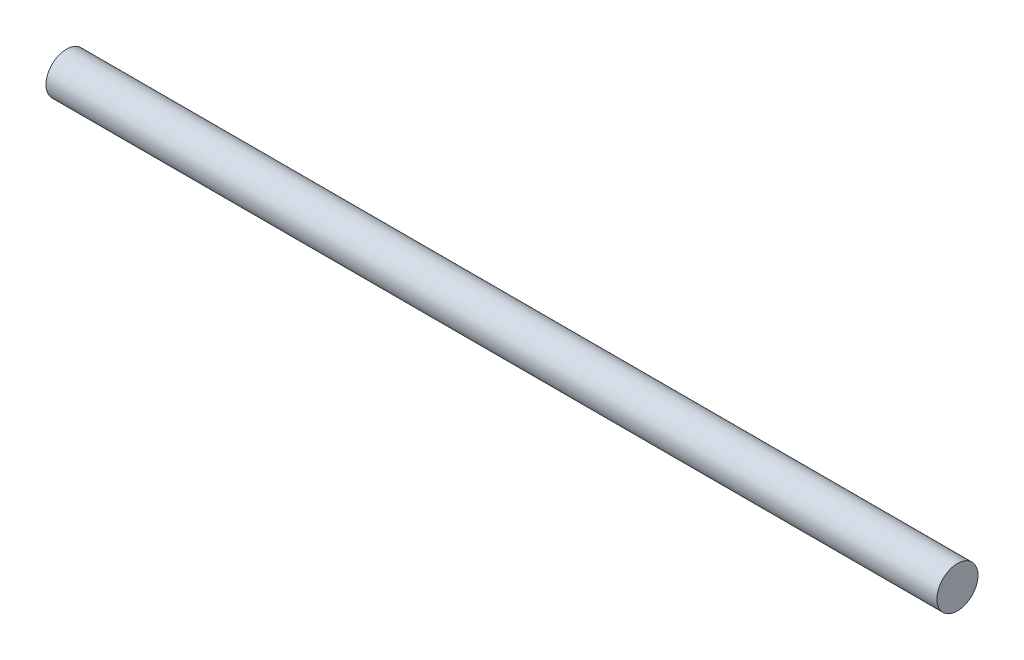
ISO-10303-21;
HEADER;
FILE_DESCRIPTION(('STEP AP214'),'2;1');
FILE_NAME('part.step','',(''),(''),'','','');
FILE_SCHEMA(('AUTOMOTIVE_DESIGN { 1 0 10303 214 1 1 1 1 }'));
ENDSEC;
DATA;
#1=APPLICATION_CONTEXT('core data for automotive mechanical design processes');
#2=APPLICATION_PROTOCOL_DEFINITION('international standard','automotive_design',2000,#1);
#3=PRODUCT_CONTEXT('',#1,'mechanical');
#4=PRODUCT('Part','Part','',(#3));
#5=PRODUCT_RELATED_PRODUCT_CATEGORY('part','',(#4));
#6=PRODUCT_DEFINITION_FORMATION('','',#4);
#7=PRODUCT_DEFINITION_CONTEXT('part definition',#1,'design');
#8=PRODUCT_DEFINITION('design','',#6,#7);
#9=PRODUCT_DEFINITION_SHAPE('','',#8);
#10=(LENGTH_UNIT() NAMED_UNIT(*) SI_UNIT(.MILLI.,.METRE.));
#11=(NAMED_UNIT(*) PLANE_ANGLE_UNIT() SI_UNIT($,.RADIAN.));
#12=(NAMED_UNIT(*) SI_UNIT($,.STERADIAN.) SOLID_ANGLE_UNIT());
#13=UNCERTAINTY_MEASURE_WITH_UNIT(LENGTH_MEASURE(1.E-05),#10,'distance_accuracy_value','');
#14=(GEOMETRIC_REPRESENTATION_CONTEXT(3) GLOBAL_UNCERTAINTY_ASSIGNED_CONTEXT((#13)) GLOBAL_UNIT_ASSIGNED_CONTEXT((#10,
#11,#12)) REPRESENTATION_CONTEXT('',''));
#15=CARTESIAN_POINT('',(0.,0.,0.));
#16=DIRECTION('',(0.,0.,1.));
#17=DIRECTION('',(1.,0.,0.));
#18=AXIS2_PLACEMENT_3D('',#15,#16,#17);
#19=CARTESIAN_POINT('',(65.,0.,0.));
#20=DIRECTION('',(-1.,0.,0.));
#21=DIRECTION('',(0.,0.,1.));
#22=AXIS2_PLACEMENT_3D('',#19,#20,#21);
#23=CYLINDRICAL_SURFACE('',#22,1.5);
#24=CARTESIAN_POINT('',(65.,0.,0.));
#25=DIRECTION('',(1.,0.,0.));
#26=DIRECTION('',(0.,0.,-1.));
#27=AXIS2_PLACEMENT_3D('',#24,#25,#26);
#28=CIRCLE('',#27,1.5);
#29=CARTESIAN_POINT('',(65.,0.,-1.5));
#30=VERTEX_POINT('',#29);
#31=EDGE_CURVE('E10',#30,#30,#28,.T.);
#32=ORIENTED_EDGE('',*,*,#31,.F.);
#33=EDGE_LOOP('',(#32));
#34=FACE_BOUND('',#33,.T.);
#35=CARTESIAN_POINT('',(0.,0.,0.));
#36=DIRECTION('',(1.,0.,0.));
#37=DIRECTION('',(0.,0.,-1.));
#38=AXIS2_PLACEMENT_3D('',#35,#36,#37);
#39=CIRCLE('',#38,1.5);
#40=CARTESIAN_POINT('',(0.,0.,-1.5));
#41=VERTEX_POINT('',#40);
#42=EDGE_CURVE('E33',#41,#41,#39,.T.);
#43=ORIENTED_EDGE('',*,*,#42,.T.);
#44=EDGE_LOOP('',(#43));
#45=FACE_BOUND('',#44,.T.);
#46=ADVANCED_FACE('F30',(#34,#45),#23,.T.);
#47=CARTESIAN_POINT('',(65.,0.,0.));
#48=DIRECTION('',(1.,0.,0.));
#49=DIRECTION('',(0.,0.,-1.));
#50=AXIS2_PLACEMENT_3D('',#47,#48,#49);
#51=PLANE('',#50);
#52=ORIENTED_EDGE('',*,*,#31,.T.);
#53=EDGE_LOOP('',(#52));
#54=FACE_BOUND('',#53,.T.);
#55=ADVANCED_FACE('F45',(#54),#51,.T.);
#56=CARTESIAN_POINT('',(0.,0.,0.));
#57=DIRECTION('',(1.,0.,0.));
#58=DIRECTION('',(0.,0.,-1.));
#59=AXIS2_PLACEMENT_3D('',#56,#57,#58);
#60=PLANE('',#59);
#61=ORIENTED_EDGE('',*,*,#42,.F.);
#62=EDGE_LOOP('',(#61));
#63=FACE_BOUND('',#62,.T.);
#64=ADVANCED_FACE('F43',(#63),#60,.F.);
#65=CLOSED_SHELL('',(#46,#55,#64));
#66=MANIFOLD_SOLID_BREP('B2',#65);
#67=ADVANCED_BREP_SHAPE_REPRESENTATION('',(#18,#66),#14);
#68=SHAPE_DEFINITION_REPRESENTATION(#9,#67);
ENDSEC;
END-ISO-10303-21;
